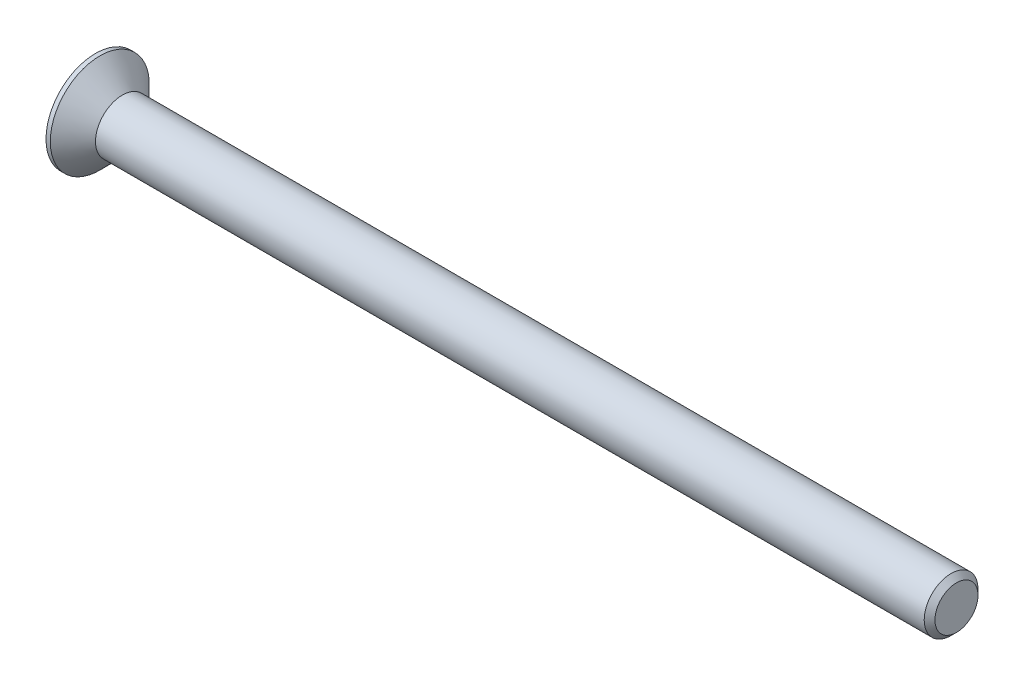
ISO-10303-21;
HEADER;
FILE_DESCRIPTION(('STEP AP214'),'2;1');
FILE_NAME('part.step','',(''),(''),'','','');
FILE_SCHEMA(('AUTOMOTIVE_DESIGN { 1 0 10303 214 1 1 1 1 }'));
ENDSEC;
DATA;
#1=APPLICATION_CONTEXT('core data for automotive mechanical design processes');
#2=APPLICATION_PROTOCOL_DEFINITION('international standard','automotive_design',2000,#1);
#3=PRODUCT_CONTEXT('',#1,'mechanical');
#4=PRODUCT('Part','Part','',(#3));
#5=PRODUCT_RELATED_PRODUCT_CATEGORY('part','',(#4));
#6=PRODUCT_DEFINITION_FORMATION('','',#4);
#7=PRODUCT_DEFINITION_CONTEXT('part definition',#1,'design');
#8=PRODUCT_DEFINITION('design','',#6,#7);
#9=PRODUCT_DEFINITION_SHAPE('','',#8);
#10=(LENGTH_UNIT() NAMED_UNIT(*) SI_UNIT(.MILLI.,.METRE.));
#11=(NAMED_UNIT(*) PLANE_ANGLE_UNIT() SI_UNIT($,.RADIAN.));
#12=(NAMED_UNIT(*) SI_UNIT($,.STERADIAN.) SOLID_ANGLE_UNIT());
#13=UNCERTAINTY_MEASURE_WITH_UNIT(LENGTH_MEASURE(1.E-05),#10,'distance_accuracy_value','');
#14=(GEOMETRIC_REPRESENTATION_CONTEXT(3) GLOBAL_UNCERTAINTY_ASSIGNED_CONTEXT((#13)) GLOBAL_UNIT_ASSIGNED_CONTEXT((#10,
#11,#12)) REPRESENTATION_CONTEXT('',''));
#15=CARTESIAN_POINT('',(0.,0.,0.));
#16=DIRECTION('',(0.,0.,1.));
#17=DIRECTION('',(1.,0.,0.));
#18=AXIS2_PLACEMENT_3D('',#15,#16,#17);
#19=CARTESIAN_POINT('',(0.,0.,0.));
#20=DIRECTION('',(-1.,0.,0.));
#21=DIRECTION('',(0.,0.,1.));
#22=AXIS2_PLACEMENT_3D('',#19,#20,#21);
#23=CONICAL_SURFACE('',#22,2.5,0.78539816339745);
#24=CARTESIAN_POINT('',(-2.09999999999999,0.,0.));
#25=DIRECTION('',(-1.,0.,0.));
#26=DIRECTION('',(0.,0.,1.));
#27=AXIS2_PLACEMENT_3D('',#24,#25,#26);
#28=CIRCLE('',#27,4.6);
#29=CARTESIAN_POINT('',(-2.09999999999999,0.,4.6));
#30=VERTEX_POINT('',#29);
#31=EDGE_CURVE('E189',#30,#30,#28,.T.);
#32=ORIENTED_EDGE('',*,*,#31,.F.);
#33=EDGE_LOOP('',(#32));
#34=FACE_BOUND('',#33,.T.);
#35=CARTESIAN_POINT('',(0.,0.,0.));
#36=DIRECTION('',(-1.,0.,0.));
#37=DIRECTION('',(0.,0.,1.));
#38=AXIS2_PLACEMENT_3D('',#35,#36,#37);
#39=CIRCLE('',#38,2.5);
#40=CARTESIAN_POINT('',(0.,0.,2.5));
#41=VERTEX_POINT('',#40);
#42=EDGE_CURVE('E212',#41,#41,#39,.T.);
#43=ORIENTED_EDGE('',*,*,#42,.T.);
#44=EDGE_LOOP('',(#43));
#45=FACE_BOUND('',#44,.T.);
#46=ADVANCED_FACE('F33',(#34,#45),#23,.T.);
#47=CARTESIAN_POINT('',(-2.5,0.,0.));
#48=DIRECTION('',(-1.,0.,0.));
#49=DIRECTION('',(0.,0.,1.));
#50=AXIS2_PLACEMENT_3D('',#47,#48,#49);
#51=CYLINDRICAL_SURFACE('',#50,2.5);
#52=CARTESIAN_POINT('',(77.,0.,0.));
#53=DIRECTION('',(-1.,0.,0.));
#54=DIRECTION('',(0.,0.,1.));
#55=AXIS2_PLACEMENT_3D('',#52,#53,#54);
#56=CIRCLE('',#55,2.5);
#57=CARTESIAN_POINT('',(77.,0.,2.5));
#58=VERTEX_POINT('',#57);
#59=EDGE_CURVE('E41',#58,#58,#56,.T.);
#60=ORIENTED_EDGE('',*,*,#59,.T.);
#61=EDGE_LOOP('',(#60));
#62=FACE_BOUND('',#61,.T.);
#63=ORIENTED_EDGE('',*,*,#42,.F.);
#64=EDGE_LOOP('',(#63));
#65=FACE_BOUND('',#64,.T.);
#66=ADVANCED_FACE('F217',(#62,#65),#51,.T.);
#67=CARTESIAN_POINT('',(77.5,0.,0.));
#68=DIRECTION('',(-1.,0.,0.));
#69=DIRECTION('',(0.,0.,1.));
#70=AXIS2_PLACEMENT_3D('',#67,#68,#69);
#71=PLANE('',#70);
#72=CARTESIAN_POINT('',(77.5,0.,0.));
#73=DIRECTION('',(-1.,0.,0.));
#74=DIRECTION('',(0.,0.,1.));
#75=AXIS2_PLACEMENT_3D('',#72,#73,#74);
#76=CIRCLE('',#75,2.);
#77=CARTESIAN_POINT('',(77.5,0.,2.));
#78=VERTEX_POINT('',#77);
#79=EDGE_CURVE('E11',#78,#78,#76,.F.);
#80=ORIENTED_EDGE('',*,*,#79,.T.);
#81=EDGE_LOOP('',(#80));
#82=FACE_BOUND('',#81,.T.);
#83=ADVANCED_FACE('F239',(#82),#71,.F.);
#84=CARTESIAN_POINT('',(-2.5,4.6,0.));
#85=DIRECTION('',(1.,0.,0.));
#86=DIRECTION('',(0.,0.,-1.));
#87=AXIS2_PLACEMENT_3D('',#84,#85,#86);
#88=PLANE('',#87);
#89=DIRECTION('',(0.,0.,-1.));
#90=VECTOR('',#89,1.);
#91=CARTESIAN_POINT('',(-2.5,0.575,-2.3));
#92=LINE('',#91,#90);
#93=CARTESIAN_POINT('',(-2.5,0.575,-0.575));
#94=VERTEX_POINT('',#93);
#95=CARTESIAN_POINT('',(-2.5,0.575,-2.3));
#96=VERTEX_POINT('',#95);
#97=EDGE_CURVE('E158',#94,#96,#92,.T.);
#98=ORIENTED_EDGE('',*,*,#97,.F.);
#99=DIRECTION('',(0.,-1.,0.));
#100=VECTOR('',#99,1.);
#101=CARTESIAN_POINT('',(-2.5,0.575,-0.575));
#102=LINE('',#101,#100);
#103=CARTESIAN_POINT('',(-2.5,2.3,-0.575));
#104=VERTEX_POINT('',#103);
#105=EDGE_CURVE('E48',#104,#94,#102,.T.);
#106=ORIENTED_EDGE('',*,*,#105,.F.);
#107=DIRECTION('',(0.,0.,-1.));
#108=VECTOR('',#107,1.);
#109=CARTESIAN_POINT('',(-2.5,2.3,-0.575));
#110=LINE('',#109,#108);
#111=CARTESIAN_POINT('',(-2.5,2.3,0.575));
#112=VERTEX_POINT('',#111);
#113=EDGE_CURVE('E185',#112,#104,#110,.T.);
#114=ORIENTED_EDGE('',*,*,#113,.F.);
#115=DIRECTION('',(0.,1.,0.));
#116=VECTOR('',#115,1.);
#117=CARTESIAN_POINT('',(-2.5,2.3,0.575));
#118=LINE('',#117,#116);
#119=CARTESIAN_POINT('',(-2.5,0.575,0.575));
#120=VERTEX_POINT('',#119);
#121=EDGE_CURVE('E183',#120,#112,#118,.T.);
#122=ORIENTED_EDGE('',*,*,#121,.F.);
#123=DIRECTION('',(0.,0.,-1.));
#124=VECTOR('',#123,1.);
#125=CARTESIAN_POINT('',(-2.5,0.575,0.575));
#126=LINE('',#125,#124);
#127=CARTESIAN_POINT('',(-2.5,0.575,2.3));
#128=VERTEX_POINT('',#127);
#129=EDGE_CURVE('E132',#128,#120,#126,.T.);
#130=ORIENTED_EDGE('',*,*,#129,.F.);
#131=DIRECTION('',(0.,1.,0.));
#132=VECTOR('',#131,1.);
#133=CARTESIAN_POINT('',(-2.5,0.575,2.3));
#134=LINE('',#133,#132);
#135=CARTESIAN_POINT('',(-2.5,-0.575,2.3));
#136=VERTEX_POINT('',#135);
#137=EDGE_CURVE('E179',#136,#128,#134,.T.);
#138=ORIENTED_EDGE('',*,*,#137,.F.);
#139=DIRECTION('',(0.,0.,1.));
#140=VECTOR('',#139,1.);
#141=CARTESIAN_POINT('',(-2.5,-0.575,2.3));
#142=LINE('',#141,#140);
#143=CARTESIAN_POINT('',(-2.5,-0.575,0.575));
#144=VERTEX_POINT('',#143);
#145=EDGE_CURVE('E176',#144,#136,#142,.T.);
#146=ORIENTED_EDGE('',*,*,#145,.F.);
#147=DIRECTION('',(0.,1.,0.));
#148=VECTOR('',#147,1.);
#149=CARTESIAN_POINT('',(-2.5,-0.575,0.575));
#150=LINE('',#149,#148);
#151=CARTESIAN_POINT('',(-2.5,-2.3,0.575));
#152=VERTEX_POINT('',#151);
#153=EDGE_CURVE('E173',#152,#144,#150,.T.);
#154=ORIENTED_EDGE('',*,*,#153,.F.);
#155=DIRECTION('',(0.,0.,1.));
#156=VECTOR('',#155,1.);
#157=CARTESIAN_POINT('',(-2.5,-2.3,0.575));
#158=LINE('',#157,#156);
#159=CARTESIAN_POINT('',(-2.5,-2.3,-0.575));
#160=VERTEX_POINT('',#159);
#161=EDGE_CURVE('E170',#160,#152,#158,.T.);
#162=ORIENTED_EDGE('',*,*,#161,.F.);
#163=DIRECTION('',(0.,-1.,0.));
#164=VECTOR('',#163,1.);
#165=CARTESIAN_POINT('',(-2.5,-2.3,-0.575));
#166=LINE('',#165,#164);
#167=CARTESIAN_POINT('',(-2.5,-0.575,-0.575));
#168=VERTEX_POINT('',#167);
#169=EDGE_CURVE('E167',#168,#160,#166,.T.);
#170=ORIENTED_EDGE('',*,*,#169,.F.);
#171=DIRECTION('',(0.,0.,1.));
#172=VECTOR('',#171,1.);
#173=CARTESIAN_POINT('',(-2.5,-0.575,-0.575));
#174=LINE('',#173,#172);
#175=CARTESIAN_POINT('',(-2.5,-0.575,-2.3));
#176=VERTEX_POINT('',#175);
#177=EDGE_CURVE('E164',#176,#168,#174,.T.);
#178=ORIENTED_EDGE('',*,*,#177,.F.);
#179=DIRECTION('',(0.,-1.,0.));
#180=VECTOR('',#179,1.);
#181=CARTESIAN_POINT('',(-2.5,-0.575,-2.3));
#182=LINE('',#181,#180);
#183=EDGE_CURVE('E161',#96,#176,#182,.T.);
#184=ORIENTED_EDGE('',*,*,#183,.F.);
#185=EDGE_LOOP('',(#98,#106,#114,#122,#130,#138,#146,#154,#162,#170,#178,#184));
#186=FACE_BOUND('',#185,.T.);
#187=CARTESIAN_POINT('',(-2.5,0.,0.));
#188=DIRECTION('',(-1.,0.,0.));
#189=DIRECTION('',(0.,0.,1.));
#190=AXIS2_PLACEMENT_3D('',#187,#188,#189);
#191=CIRCLE('',#190,4.6);
#192=CARTESIAN_POINT('',(-2.5,0.,4.6));
#193=VERTEX_POINT('',#192);
#194=EDGE_CURVE('E209',#193,#193,#191,.T.);
#195=ORIENTED_EDGE('',*,*,#194,.T.);
#196=EDGE_LOOP('',(#195));
#197=FACE_BOUND('',#196,.T.);
#198=ADVANCED_FACE('F230',(#186,#197),#88,.F.);
#199=CARTESIAN_POINT('',(-2.5,0.,0.));
#200=DIRECTION('',(-1.,0.,0.));
#201=DIRECTION('',(0.,0.,1.));
#202=AXIS2_PLACEMENT_3D('',#199,#200,#201);
#203=CYLINDRICAL_SURFACE('',#202,4.6);
#204=ORIENTED_EDGE('',*,*,#194,.F.);
#205=EDGE_LOOP('',(#204));
#206=FACE_BOUND('',#205,.T.);
#207=ORIENTED_EDGE('',*,*,#31,.T.);
#208=EDGE_LOOP('',(#207));
#209=FACE_BOUND('',#208,.T.);
#210=ADVANCED_FACE('F222',(#206,#209),#203,.T.);
#211=CARTESIAN_POINT('',(77.,0.,0.));
#212=DIRECTION('',(-1.,0.,0.));
#213=DIRECTION('',(0.,0.,1.));
#214=AXIS2_PLACEMENT_3D('',#211,#212,#213);
#215=CONICAL_SURFACE('',#214,2.5,0.78539816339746);
#216=ORIENTED_EDGE('',*,*,#79,.F.);
#217=EDGE_LOOP('',(#216));
#218=FACE_BOUND('',#217,.T.);
#219=ORIENTED_EDGE('',*,*,#59,.F.);
#220=EDGE_LOOP('',(#219));
#221=FACE_BOUND('',#220,.T.);
#222=ADVANCED_FACE('F35',(#218,#221),#215,.T.);
#223=CARTESIAN_POINT('',(-0.4,0.575,-0.575));
#224=DIRECTION('',(0.,0.,-1.));
#225=DIRECTION('',(-1.,0.,0.));
#226=AXIS2_PLACEMENT_3D('',#223,#224,#225);
#227=PLANE('',#226);
#228=ORIENTED_EDGE('',*,*,#105,.T.);
#229=DIRECTION('',(-1.,0.,0.));
#230=VECTOR('',#229,1.);
#231=CARTESIAN_POINT('',(-0.4,0.575,-0.575));
#232=LINE('',#231,#230);
#233=CARTESIAN_POINT('',(-0.4,0.575,-0.575));
#234=VERTEX_POINT('',#233);
#235=EDGE_CURVE('E96',#234,#94,#232,.T.);
#236=ORIENTED_EDGE('',*,*,#235,.F.);
#237=DIRECTION('',(0.,-1.,0.));
#238=VECTOR('',#237,1.);
#239=CARTESIAN_POINT('',(-0.4,0.575,-0.575));
#240=LINE('',#239,#238);
#241=CARTESIAN_POINT('',(-0.4,2.3,-0.575));
#242=VERTEX_POINT('',#241);
#243=EDGE_CURVE('E187',#242,#234,#240,.T.);
#244=ORIENTED_EDGE('',*,*,#243,.F.);
#245=DIRECTION('',(-1.,0.,0.));
#246=VECTOR('',#245,1.);
#247=CARTESIAN_POINT('',(-0.4,2.3,-0.575));
#248=LINE('',#247,#246);
#249=EDGE_CURVE('E56',#242,#104,#248,.T.);
#250=ORIENTED_EDGE('',*,*,#249,.T.);
#251=EDGE_LOOP('',(#228,#236,#244,#250));
#252=FACE_BOUND('',#251,.T.);
#253=ADVANCED_FACE('F221',(#252),#227,.F.);
#254=CARTESIAN_POINT('',(-0.4,2.3,-0.575));
#255=DIRECTION('',(0.,1.,0.));
#256=DIRECTION('',(-1.,0.,0.));
#257=AXIS2_PLACEMENT_3D('',#254,#255,#256);
#258=PLANE('',#257);
#259=ORIENTED_EDGE('',*,*,#113,.T.);
#260=ORIENTED_EDGE('',*,*,#249,.F.);
#261=DIRECTION('',(0.,0.,-1.));
#262=VECTOR('',#261,1.);
#263=CARTESIAN_POINT('',(-0.4,2.3,-0.575));
#264=LINE('',#263,#262);
#265=CARTESIAN_POINT('',(-0.4,2.3,0.575));
#266=VERTEX_POINT('',#265);
#267=EDGE_CURVE('E144',#266,#242,#264,.T.);
#268=ORIENTED_EDGE('',*,*,#267,.F.);
#269=DIRECTION('',(-1.,0.,0.));
#270=VECTOR('',#269,1.);
#271=CARTESIAN_POINT('',(-0.4,2.3,0.575));
#272=LINE('',#271,#270);
#273=EDGE_CURVE('E136',#266,#112,#272,.T.);
#274=ORIENTED_EDGE('',*,*,#273,.T.);
#275=EDGE_LOOP('',(#259,#260,#268,#274));
#276=FACE_BOUND('',#275,.T.);
#277=ADVANCED_FACE('F228',(#276),#258,.F.);
#278=CARTESIAN_POINT('',(-0.4,2.3,0.575));
#279=DIRECTION('',(0.,0.,1.));
#280=DIRECTION('',(1.,0.,0.));
#281=AXIS2_PLACEMENT_3D('',#278,#279,#280);
#282=PLANE('',#281);
#283=ORIENTED_EDGE('',*,*,#121,.T.);
#284=ORIENTED_EDGE('',*,*,#273,.F.);
#285=DIRECTION('',(0.,1.,0.));
#286=VECTOR('',#285,1.);
#287=CARTESIAN_POINT('',(-0.4,2.3,0.575));
#288=LINE('',#287,#286);
#289=CARTESIAN_POINT('',(-0.4,0.575,0.575));
#290=VERTEX_POINT('',#289);
#291=EDGE_CURVE('E140',#290,#266,#288,.T.);
#292=ORIENTED_EDGE('',*,*,#291,.F.);
#293=DIRECTION('',(-1.,0.,0.));
#294=VECTOR('',#293,1.);
#295=CARTESIAN_POINT('',(-0.4,0.575,0.575));
#296=LINE('',#295,#294);
#297=EDGE_CURVE('E125',#290,#120,#296,.T.);
#298=ORIENTED_EDGE('',*,*,#297,.T.);
#299=EDGE_LOOP('',(#283,#284,#292,#298));
#300=FACE_BOUND('',#299,.T.);
#301=ADVANCED_FACE('F141',(#300),#282,.F.);
#302=CARTESIAN_POINT('',(-0.4,0.575,0.575));
#303=DIRECTION('',(0.,1.,0.));
#304=DIRECTION('',(-1.,0.,0.));
#305=AXIS2_PLACEMENT_3D('',#302,#303,#304);
#306=PLANE('',#305);
#307=ORIENTED_EDGE('',*,*,#129,.T.);
#308=ORIENTED_EDGE('',*,*,#297,.F.);
#309=DIRECTION('',(0.,0.,-1.));
#310=VECTOR('',#309,1.);
#311=CARTESIAN_POINT('',(-0.4,0.575,0.575));
#312=LINE('',#311,#310);
#313=CARTESIAN_POINT('',(-0.4,0.575,2.3));
#314=VERTEX_POINT('',#313);
#315=EDGE_CURVE('E129',#314,#290,#312,.T.);
#316=ORIENTED_EDGE('',*,*,#315,.F.);
#317=DIRECTION('',(-1.,0.,0.));
#318=VECTOR('',#317,1.);
#319=CARTESIAN_POINT('',(-0.4,0.575,2.3));
#320=LINE('',#319,#318);
#321=EDGE_CURVE('E137',#314,#128,#320,.T.);
#322=ORIENTED_EDGE('',*,*,#321,.T.);
#323=EDGE_LOOP('',(#307,#308,#316,#322));
#324=FACE_BOUND('',#323,.T.);
#325=ADVANCED_FACE('F127',(#324),#306,.F.);
#326=CARTESIAN_POINT('',(-0.4,0.575,2.3));
#327=DIRECTION('',(0.,0.,1.));
#328=DIRECTION('',(1.,0.,0.));
#329=AXIS2_PLACEMENT_3D('',#326,#327,#328);
#330=PLANE('',#329);
#331=ORIENTED_EDGE('',*,*,#137,.T.);
#332=ORIENTED_EDGE('',*,*,#321,.F.);
#333=DIRECTION('',(0.,1.,0.));
#334=VECTOR('',#333,1.);
#335=CARTESIAN_POINT('',(-0.4,0.575,2.3));
#336=LINE('',#335,#334);
#337=CARTESIAN_POINT('',(-0.4,-0.575,2.3));
#338=VERTEX_POINT('',#337);
#339=EDGE_CURVE('E150',#338,#314,#336,.T.);
#340=ORIENTED_EDGE('',*,*,#339,.F.);
#341=DIRECTION('',(-1.,0.,0.));
#342=VECTOR('',#341,1.);
#343=CARTESIAN_POINT('',(-0.4,-0.575,2.3));
#344=LINE('',#343,#342);
#345=EDGE_CURVE('E192',#338,#136,#344,.T.);
#346=ORIENTED_EDGE('',*,*,#345,.T.);
#347=EDGE_LOOP('',(#331,#332,#340,#346));
#348=FACE_BOUND('',#347,.T.);
#349=ADVANCED_FACE('F277',(#348),#330,.F.);
#350=CARTESIAN_POINT('',(-0.4,-0.575,2.3));
#351=DIRECTION('',(0.,-1.,0.));
#352=DIRECTION('',(1.,0.,0.));
#353=AXIS2_PLACEMENT_3D('',#350,#351,#352);
#354=PLANE('',#353);
#355=ORIENTED_EDGE('',*,*,#145,.T.);
#356=ORIENTED_EDGE('',*,*,#345,.F.);
#357=DIRECTION('',(0.,0.,1.));
#358=VECTOR('',#357,1.);
#359=CARTESIAN_POINT('',(-0.4,-0.575,2.3));
#360=LINE('',#359,#358);
#361=CARTESIAN_POINT('',(-0.4,-0.575,0.575));
#362=VERTEX_POINT('',#361);
#363=EDGE_CURVE('E152',#362,#338,#360,.T.);
#364=ORIENTED_EDGE('',*,*,#363,.F.);
#365=DIRECTION('',(-1.,0.,0.));
#366=VECTOR('',#365,1.);
#367=CARTESIAN_POINT('',(-0.4,-0.575,0.575));
#368=LINE('',#367,#366);
#369=EDGE_CURVE('E194',#362,#144,#368,.T.);
#370=ORIENTED_EDGE('',*,*,#369,.T.);
#371=EDGE_LOOP('',(#355,#356,#364,#370));
#372=FACE_BOUND('',#371,.T.);
#373=ADVANCED_FACE('F273',(#372),#354,.F.);
#374=CARTESIAN_POINT('',(-0.4,-0.575,0.575));
#375=DIRECTION('',(0.,0.,1.));
#376=DIRECTION('',(1.,0.,0.));
#377=AXIS2_PLACEMENT_3D('',#374,#375,#376);
#378=PLANE('',#377);
#379=ORIENTED_EDGE('',*,*,#153,.T.);
#380=ORIENTED_EDGE('',*,*,#369,.F.);
#381=DIRECTION('',(0.,1.,0.));
#382=VECTOR('',#381,1.);
#383=CARTESIAN_POINT('',(-0.4,-0.575,0.575));
#384=LINE('',#383,#382);
#385=CARTESIAN_POINT('',(-0.4,-2.3,0.575));
#386=VERTEX_POINT('',#385);
#387=EDGE_CURVE('E422',#386,#362,#384,.T.);
#388=ORIENTED_EDGE('',*,*,#387,.F.);
#389=DIRECTION('',(-1.,0.,0.));
#390=VECTOR('',#389,1.);
#391=CARTESIAN_POINT('',(-0.4,-2.3,0.575));
#392=LINE('',#391,#390);
#393=EDGE_CURVE('E196',#386,#152,#392,.T.);
#394=ORIENTED_EDGE('',*,*,#393,.T.);
#395=EDGE_LOOP('',(#379,#380,#388,#394));
#396=FACE_BOUND('',#395,.T.);
#397=ADVANCED_FACE('F269',(#396),#378,.F.);
#398=CARTESIAN_POINT('',(-0.4,-2.3,0.575));
#399=DIRECTION('',(0.,-1.,0.));
#400=DIRECTION('',(1.,0.,0.));
#401=AXIS2_PLACEMENT_3D('',#398,#399,#400);
#402=PLANE('',#401);
#403=ORIENTED_EDGE('',*,*,#161,.T.);
#404=ORIENTED_EDGE('',*,*,#393,.F.);
#405=DIRECTION('',(0.,0.,1.));
#406=VECTOR('',#405,1.);
#407=CARTESIAN_POINT('',(-0.4,-2.3,0.575));
#408=LINE('',#407,#406);
#409=CARTESIAN_POINT('',(-0.4,-2.3,-0.575));
#410=VERTEX_POINT('',#409);
#411=EDGE_CURVE('E419',#410,#386,#408,.T.);
#412=ORIENTED_EDGE('',*,*,#411,.F.);
#413=DIRECTION('',(-1.,0.,0.));
#414=VECTOR('',#413,1.);
#415=CARTESIAN_POINT('',(-0.4,-2.3,-0.575));
#416=LINE('',#415,#414);
#417=EDGE_CURVE('E198',#410,#160,#416,.T.);
#418=ORIENTED_EDGE('',*,*,#417,.T.);
#419=EDGE_LOOP('',(#403,#404,#412,#418));
#420=FACE_BOUND('',#419,.T.);
#421=ADVANCED_FACE('F265',(#420),#402,.F.);
#422=CARTESIAN_POINT('',(-0.4,-2.3,-0.575));
#423=DIRECTION('',(0.,0.,-1.));
#424=DIRECTION('',(-1.,0.,0.));
#425=AXIS2_PLACEMENT_3D('',#422,#423,#424);
#426=PLANE('',#425);
#427=ORIENTED_EDGE('',*,*,#169,.T.);
#428=ORIENTED_EDGE('',*,*,#417,.F.);
#429=DIRECTION('',(0.,-1.,0.));
#430=VECTOR('',#429,1.);
#431=CARTESIAN_POINT('',(-0.4,-2.3,-0.575));
#432=LINE('',#431,#430);
#433=CARTESIAN_POINT('',(-0.4,-0.575,-0.575));
#434=VERTEX_POINT('',#433);
#435=EDGE_CURVE('E416',#434,#410,#432,.T.);
#436=ORIENTED_EDGE('',*,*,#435,.F.);
#437=DIRECTION('',(-1.,0.,0.));
#438=VECTOR('',#437,1.);
#439=CARTESIAN_POINT('',(-0.4,-0.575,-0.575));
#440=LINE('',#439,#438);
#441=EDGE_CURVE('E200',#434,#168,#440,.T.);
#442=ORIENTED_EDGE('',*,*,#441,.T.);
#443=EDGE_LOOP('',(#427,#428,#436,#442));
#444=FACE_BOUND('',#443,.T.);
#445=ADVANCED_FACE('F261',(#444),#426,.F.);
#446=CARTESIAN_POINT('',(-0.4,-0.575,-0.575));
#447=DIRECTION('',(0.,-1.,0.));
#448=DIRECTION('',(1.,0.,0.));
#449=AXIS2_PLACEMENT_3D('',#446,#447,#448);
#450=PLANE('',#449);
#451=ORIENTED_EDGE('',*,*,#177,.T.);
#452=ORIENTED_EDGE('',*,*,#441,.F.);
#453=DIRECTION('',(0.,0.,1.));
#454=VECTOR('',#453,1.);
#455=CARTESIAN_POINT('',(-0.4,-0.575,-0.575));
#456=LINE('',#455,#454);
#457=CARTESIAN_POINT('',(-0.4,-0.575,-2.3));
#458=VERTEX_POINT('',#457);
#459=EDGE_CURVE('E413',#458,#434,#456,.T.);
#460=ORIENTED_EDGE('',*,*,#459,.F.);
#461=DIRECTION('',(-1.,0.,0.));
#462=VECTOR('',#461,1.);
#463=CARTESIAN_POINT('',(-0.4,-0.575,-2.3));
#464=LINE('',#463,#462);
#465=EDGE_CURVE('E202',#458,#176,#464,.T.);
#466=ORIENTED_EDGE('',*,*,#465,.T.);
#467=EDGE_LOOP('',(#451,#452,#460,#466));
#468=FACE_BOUND('',#467,.T.);
#469=ADVANCED_FACE('F257',(#468),#450,.F.);
#470=CARTESIAN_POINT('',(-0.4,-0.575,-2.3));
#471=DIRECTION('',(0.,0.,-1.));
#472=DIRECTION('',(-1.,0.,0.));
#473=AXIS2_PLACEMENT_3D('',#470,#471,#472);
#474=PLANE('',#473);
#475=ORIENTED_EDGE('',*,*,#183,.T.);
#476=ORIENTED_EDGE('',*,*,#465,.F.);
#477=DIRECTION('',(0.,-1.,0.));
#478=VECTOR('',#477,1.);
#479=CARTESIAN_POINT('',(-0.4,-0.575,-2.3));
#480=LINE('',#479,#478);
#481=CARTESIAN_POINT('',(-0.4,0.575,-2.3));
#482=VERTEX_POINT('',#481);
#483=EDGE_CURVE('E408',#482,#458,#480,.T.);
#484=ORIENTED_EDGE('',*,*,#483,.F.);
#485=DIRECTION('',(-1.,0.,0.));
#486=VECTOR('',#485,1.);
#487=CARTESIAN_POINT('',(-0.4,0.575,-2.3));
#488=LINE('',#487,#486);
#489=EDGE_CURVE('E204',#482,#96,#488,.T.);
#490=ORIENTED_EDGE('',*,*,#489,.T.);
#491=EDGE_LOOP('',(#475,#476,#484,#490));
#492=FACE_BOUND('',#491,.T.);
#493=ADVANCED_FACE('F253',(#492),#474,.F.);
#494=CARTESIAN_POINT('',(-0.4,0.575,-2.3));
#495=DIRECTION('',(0.,1.,0.));
#496=DIRECTION('',(-1.,0.,0.));
#497=AXIS2_PLACEMENT_3D('',#494,#495,#496);
#498=PLANE('',#497);
#499=ORIENTED_EDGE('',*,*,#97,.T.);
#500=ORIENTED_EDGE('',*,*,#489,.F.);
#501=DIRECTION('',(0.,0.,-1.));
#502=VECTOR('',#501,1.);
#503=CARTESIAN_POINT('',(-0.4,0.575,-2.3));
#504=LINE('',#503,#502);
#505=EDGE_CURVE('E406',#234,#482,#504,.T.);
#506=ORIENTED_EDGE('',*,*,#505,.F.);
#507=ORIENTED_EDGE('',*,*,#235,.T.);
#508=EDGE_LOOP('',(#499,#500,#506,#507));
#509=FACE_BOUND('',#508,.T.);
#510=ADVANCED_FACE('F250',(#509),#498,.F.);
#511=CARTESIAN_POINT('',(-0.4,0.,0.));
#512=DIRECTION('',(1.,0.,0.));
#513=DIRECTION('',(0.,0.,-1.));
#514=AXIS2_PLACEMENT_3D('',#511,#512,#513);
#515=PLANE('',#514);
#516=ORIENTED_EDGE('',*,*,#243,.T.);
#517=ORIENTED_EDGE('',*,*,#505,.T.);
#518=ORIENTED_EDGE('',*,*,#483,.T.);
#519=ORIENTED_EDGE('',*,*,#459,.T.);
#520=ORIENTED_EDGE('',*,*,#435,.T.);
#521=ORIENTED_EDGE('',*,*,#411,.T.);
#522=ORIENTED_EDGE('',*,*,#387,.T.);
#523=ORIENTED_EDGE('',*,*,#363,.T.);
#524=ORIENTED_EDGE('',*,*,#339,.T.);
#525=ORIENTED_EDGE('',*,*,#315,.T.);
#526=ORIENTED_EDGE('',*,*,#291,.T.);
#527=ORIENTED_EDGE('',*,*,#267,.T.);
#528=EDGE_LOOP('',(#516,#517,#518,#519,#520,#521,#522,#523,#524,#525,#526,#527));
#529=FACE_BOUND('',#528,.T.);
#530=ADVANCED_FACE('F147',(#529),#515,.F.);
#531=CLOSED_SHELL('',(#46,#66,#83,#198,#210,#222,#253,#277,#301,#325,#349,#373,#397,#421,#445,
#469,#493,#510,#530));
#532=MANIFOLD_SOLID_BREP('B2',#531);
#533=ADVANCED_BREP_SHAPE_REPRESENTATION('',(#18,#532),#14);
#534=SHAPE_DEFINITION_REPRESENTATION(#9,#533);
ENDSEC;
END-ISO-10303-21;
